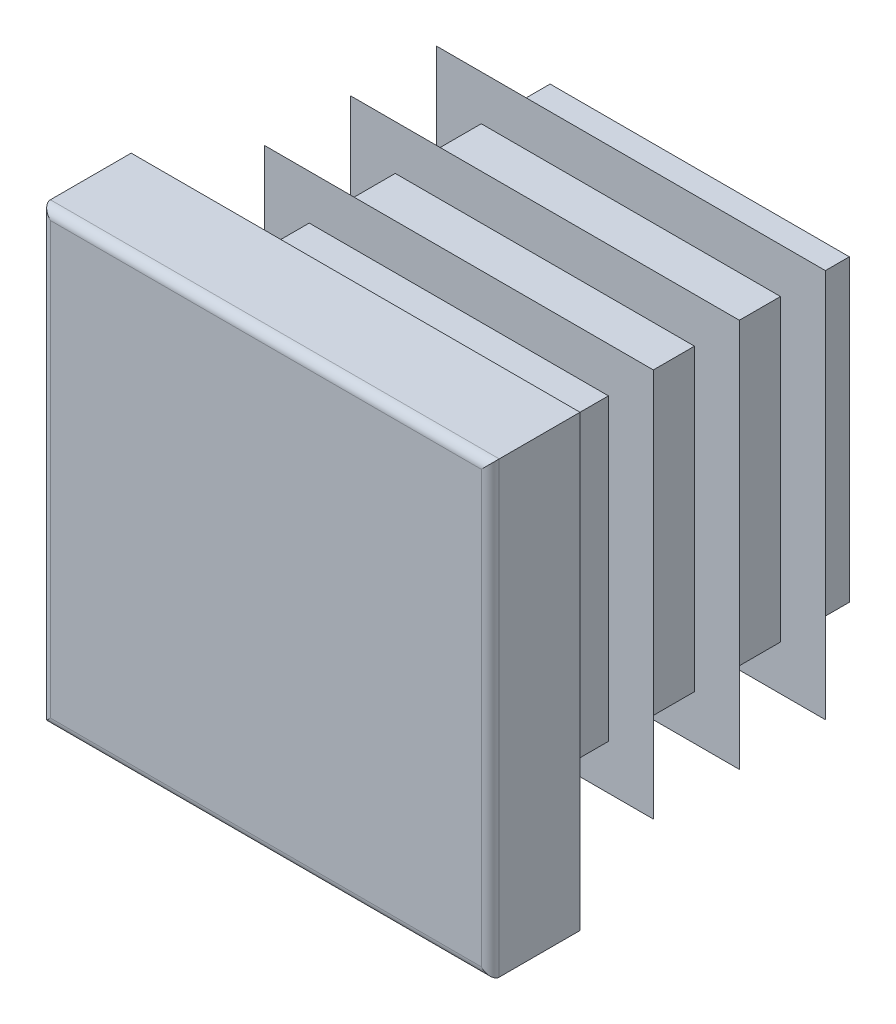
ISO-10303-21;
HEADER;
FILE_DESCRIPTION(('STEP AP214'),'2;1');
FILE_NAME('part.step','',(''),(''),'','','');
FILE_SCHEMA(('AUTOMOTIVE_DESIGN { 1 0 10303 214 1 1 1 1 }'));
ENDSEC;
DATA;
#1=APPLICATION_CONTEXT('core data for automotive mechanical design processes');
#2=APPLICATION_PROTOCOL_DEFINITION('international standard','automotive_design',2000,#1);
#3=PRODUCT_CONTEXT('',#1,'mechanical');
#4=PRODUCT('Part','Part','',(#3));
#5=PRODUCT_RELATED_PRODUCT_CATEGORY('part','',(#4));
#6=PRODUCT_DEFINITION_FORMATION('','',#4);
#7=PRODUCT_DEFINITION_CONTEXT('part definition',#1,'design');
#8=PRODUCT_DEFINITION('design','',#6,#7);
#9=PRODUCT_DEFINITION_SHAPE('','',#8);
#10=(LENGTH_UNIT() NAMED_UNIT(*) SI_UNIT(.MILLI.,.METRE.));
#11=(NAMED_UNIT(*) PLANE_ANGLE_UNIT() SI_UNIT($,.RADIAN.));
#12=(NAMED_UNIT(*) SI_UNIT($,.STERADIAN.) SOLID_ANGLE_UNIT());
#13=UNCERTAINTY_MEASURE_WITH_UNIT(LENGTH_MEASURE(1.E-05),#10,'distance_accuracy_value','');
#14=(GEOMETRIC_REPRESENTATION_CONTEXT(3) GLOBAL_UNCERTAINTY_ASSIGNED_CONTEXT((#13)) GLOBAL_UNIT_ASSIGNED_CONTEXT((#10,
#11,#12)) REPRESENTATION_CONTEXT('',''));
#15=CARTESIAN_POINT('',(0.,0.,0.));
#16=DIRECTION('',(0.,0.,1.));
#17=DIRECTION('',(1.,0.,0.));
#18=AXIS2_PLACEMENT_3D('',#15,#16,#17);
#19=CARTESIAN_POINT('',(7.2,-7.5,3.));
#20=DIRECTION('',(0.,0.,-1.));
#21=DIRECTION('',(0.,1.,0.));
#22=AXIS2_PLACEMENT_3D('',#19,#20,#21);
#23=PLANE('',#22);
#24=DIRECTION('',(0.,1.,0.));
#25=VECTOR('',#24,1.);
#26=CARTESIAN_POINT('',(-7.2,-7.5,3.));
#27=LINE('',#26,#25);
#28=CARTESIAN_POINT('',(-7.2,-7.2,3.));
#29=VERTEX_POINT('',#28);
#30=CARTESIAN_POINT('',(-7.2,7.2,3.));
#31=VERTEX_POINT('',#30);
#32=EDGE_CURVE('E262',#29,#31,#27,.T.);
#33=ORIENTED_EDGE('',*,*,#32,.F.);
#34=DIRECTION('',(-1.,0.,0.));
#35=VECTOR('',#34,1.);
#36=CARTESIAN_POINT('',(7.5,-7.2,3.));
#37=LINE('',#36,#35);
#38=CARTESIAN_POINT('',(7.2,-7.2,3.));
#39=VERTEX_POINT('',#38);
#40=EDGE_CURVE('E432',#39,#29,#37,.T.);
#41=ORIENTED_EDGE('',*,*,#40,.F.);
#42=DIRECTION('',(0.,1.,0.));
#43=VECTOR('',#42,1.);
#44=CARTESIAN_POINT('',(7.2,-7.5,3.));
#45=LINE('',#44,#43);
#46=CARTESIAN_POINT('',(7.2,7.2,3.));
#47=VERTEX_POINT('',#46);
#48=EDGE_CURVE('E257',#39,#47,#45,.T.);
#49=ORIENTED_EDGE('',*,*,#48,.T.);
#50=DIRECTION('',(-1.,0.,0.));
#51=VECTOR('',#50,1.);
#52=CARTESIAN_POINT('',(7.5,7.2,3.));
#53=LINE('',#52,#51);
#54=EDGE_CURVE('E534',#47,#31,#53,.T.);
#55=ORIENTED_EDGE('',*,*,#54,.T.);
#56=EDGE_LOOP('',(#33,#41,#49,#55));
#57=FACE_BOUND('',#56,.T.);
#58=ADVANCED_FACE('F14',(#57),#23,.F.);
#59=CARTESIAN_POINT('',(-7.2,-7.5,2.7));
#60=DIRECTION('',(0.,1.,0.));
#61=DIRECTION('',(-1.,0.,0.));
#62=AXIS2_PLACEMENT_3D('',#59,#60,#61);
#63=CYLINDRICAL_SURFACE('',#62,0.3);
#64=DIRECTION('',(0.,1.,0.));
#65=VECTOR('',#64,1.);
#66=CARTESIAN_POINT('',(-7.5,-7.5,2.7));
#67=LINE('',#66,#65);
#68=CARTESIAN_POINT('',(-7.5,-7.5,2.7));
#69=VERTEX_POINT('',#68);
#70=CARTESIAN_POINT('',(-7.5,7.5,2.7));
#71=VERTEX_POINT('',#70);
#72=EDGE_CURVE('E354',#69,#71,#67,.T.);
#73=ORIENTED_EDGE('',*,*,#72,.F.);
#74=CARTESIAN_POINT('',(-7.2,-7.2,2.7));
#75=DIRECTION('',(-0.707106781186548,0.707106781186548,0.));
#76=DIRECTION('',(0.707106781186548,0.707106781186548,0.));
#77=AXIS2_PLACEMENT_3D('',#74,#75,#76);
#78=ELLIPSE('',#77,0.424264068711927,0.3);
#79=EDGE_CURVE('E59',#69,#29,#78,.T.);
#80=ORIENTED_EDGE('',*,*,#79,.T.);
#81=ORIENTED_EDGE('',*,*,#32,.T.);
#82=CARTESIAN_POINT('',(-7.2,7.2,2.7));
#83=DIRECTION('',(0.707106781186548,0.707106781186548,0.));
#84=DIRECTION('',(-0.707106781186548,0.707106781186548,0.));
#85=AXIS2_PLACEMENT_3D('',#82,#83,#84);
#86=ELLIPSE('',#85,0.424264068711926,0.3);
#87=EDGE_CURVE('E258',#31,#71,#86,.F.);
#88=ORIENTED_EDGE('',*,*,#87,.T.);
#89=EDGE_LOOP('',(#73,#80,#81,#88));
#90=FACE_BOUND('',#89,.T.);
#91=ADVANCED_FACE('F16',(#90),#63,.T.);
#92=CARTESIAN_POINT('',(-7.5,-7.5,2.7));
#93=DIRECTION('',(1.,0.,0.));
#94=DIRECTION('',(0.,1.,0.));
#95=AXIS2_PLACEMENT_3D('',#92,#93,#94);
#96=PLANE('',#95);
#97=DIRECTION('',(0.,0.,-1.));
#98=VECTOR('',#97,1.);
#99=CARTESIAN_POINT('',(-7.5,7.5,2.7));
#100=LINE('',#99,#98);
#101=CARTESIAN_POINT('',(-7.5,7.5,0.));
#102=VERTEX_POINT('',#101);
#103=EDGE_CURVE('E519',#71,#102,#100,.T.);
#104=ORIENTED_EDGE('',*,*,#103,.T.);
#105=DIRECTION('',(0.,1.,0.));
#106=VECTOR('',#105,1.);
#107=CARTESIAN_POINT('',(-7.5,-7.5,0.));
#108=LINE('',#107,#106);
#109=CARTESIAN_POINT('',(-7.5,-7.5,0.));
#110=VERTEX_POINT('',#109);
#111=EDGE_CURVE('E352',#110,#102,#108,.T.);
#112=ORIENTED_EDGE('',*,*,#111,.F.);
#113=DIRECTION('',(0.,0.,-1.));
#114=VECTOR('',#113,1.);
#115=CARTESIAN_POINT('',(-7.5,-7.5,2.7));
#116=LINE('',#115,#114);
#117=EDGE_CURVE('E520',#69,#110,#116,.T.);
#118=ORIENTED_EDGE('',*,*,#117,.F.);
#119=ORIENTED_EDGE('',*,*,#72,.T.);
#120=EDGE_LOOP('',(#104,#112,#118,#119));
#121=FACE_BOUND('',#120,.T.);
#122=ADVANCED_FACE('F604',(#121),#96,.F.);
#123=CARTESIAN_POINT('',(-5.,-7.5,0.));
#124=DIRECTION('',(1.,0.,0.));
#125=DIRECTION('',(0.,1.,0.));
#126=AXIS2_PLACEMENT_3D('',#123,#124,#125);
#127=PLANE('',#126);
#128=DIRECTION('',(0.,1.,0.));
#129=VECTOR('',#128,1.);
#130=CARTESIAN_POINT('',(-5.,-7.5,0.));
#131=LINE('',#130,#129);
#132=CARTESIAN_POINT('',(-5.,-5.,0.));
#133=VERTEX_POINT('',#132);
#134=CARTESIAN_POINT('',(-5.,5.,0.));
#135=VERTEX_POINT('',#134);
#136=EDGE_CURVE('E349',#133,#135,#131,.T.);
#137=ORIENTED_EDGE('',*,*,#136,.T.);
#138=DIRECTION('',(0.,0.,-1.));
#139=VECTOR('',#138,1.);
#140=CARTESIAN_POINT('',(-5.,5.,0.));
#141=LINE('',#140,#139);
#142=CARTESIAN_POINT('',(-5.,5.,-0.575));
#143=VERTEX_POINT('',#142);
#144=EDGE_CURVE('E445',#135,#143,#141,.T.);
#145=ORIENTED_EDGE('',*,*,#144,.T.);
#146=DIRECTION('',(0.,1.,0.));
#147=VECTOR('',#146,1.);
#148=CARTESIAN_POINT('',(-5.,-7.5,-0.575));
#149=LINE('',#148,#147);
#150=CARTESIAN_POINT('',(-5.,-5.,-0.575));
#151=VERTEX_POINT('',#150);
#152=EDGE_CURVE('E346',#151,#143,#149,.T.);
#153=ORIENTED_EDGE('',*,*,#152,.F.);
#154=DIRECTION('',(0.,0.,1.));
#155=VECTOR('',#154,1.);
#156=CARTESIAN_POINT('',(-5.,-5.,0.));
#157=LINE('',#156,#155);
#158=EDGE_CURVE('E439',#151,#133,#157,.T.);
#159=ORIENTED_EDGE('',*,*,#158,.T.);
#160=EDGE_LOOP('',(#137,#145,#153,#159));
#161=FACE_BOUND('',#160,.T.);
#162=ADVANCED_FACE('F728',(#161),#127,.F.);
#163=CARTESIAN_POINT('',(-6.5,-7.5,-0.575));
#164=DIRECTION('',(0.573576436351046,0.,0.819152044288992));
#165=DIRECTION('',(-0.819152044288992,0.,0.573576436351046));
#166=AXIS2_PLACEMENT_3D('',#163,#164,#165);
#167=PLANE('',#166);
#168=DIRECTION('',(0.,1.,0.));
#169=VECTOR('',#168,1.);
#170=CARTESIAN_POINT('',(-6.5,-7.5,-0.575));
#171=LINE('',#170,#169);
#172=CARTESIAN_POINT('',(-6.5,-6.5,-0.575));
#173=VERTEX_POINT('',#172);
#174=CARTESIAN_POINT('',(-6.5,6.5,-0.575));
#175=VERTEX_POINT('',#174);
#176=EDGE_CURVE('E344',#173,#175,#171,.T.);
#177=ORIENTED_EDGE('',*,*,#176,.T.);
#178=DIRECTION('',(0.633687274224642,-0.633687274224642,-0.443712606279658));
#179=VECTOR('',#178,1.);
#180=CARTESIAN_POINT('',(-0.878166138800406,0.878166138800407,-4.51145044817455));
#181=LINE('',#180,#179);
#182=CARTESIAN_POINT('',(-5.,5.,-1.62531130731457));
#183=VERTEX_POINT('',#182);
#184=EDGE_CURVE('E457',#175,#183,#181,.T.);
#185=ORIENTED_EDGE('',*,*,#184,.T.);
#186=DIRECTION('',(0.,1.,0.));
#187=VECTOR('',#186,1.);
#188=CARTESIAN_POINT('',(-5.,-7.5,-1.62531130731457));
#189=LINE('',#188,#187);
#190=CARTESIAN_POINT('',(-5.,-5.,-1.62531130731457));
#191=VERTEX_POINT('',#190);
#192=EDGE_CURVE('E341',#191,#183,#189,.T.);
#193=ORIENTED_EDGE('',*,*,#192,.F.);
#194=DIRECTION('',(-0.633687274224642,-0.633687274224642,0.443712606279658));
#195=VECTOR('',#194,1.);
#196=CARTESIAN_POINT('',(-6.90155956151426,-6.90155956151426,-0.293824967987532));
#197=LINE('',#196,#195);
#198=EDGE_CURVE('E451',#191,#173,#197,.T.);
#199=ORIENTED_EDGE('',*,*,#198,.T.);
#200=EDGE_LOOP('',(#177,#185,#193,#199));
#201=FACE_BOUND('',#200,.T.);
#202=ADVANCED_FACE('F732',(#201),#167,.F.);
#203=CARTESIAN_POINT('',(-5.,-7.5,-1.62531130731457));
#204=DIRECTION('',(1.,0.,0.));
#205=DIRECTION('',(0.,1.,0.));
#206=AXIS2_PLACEMENT_3D('',#203,#204,#205);
#207=PLANE('',#206);
#208=ORIENTED_EDGE('',*,*,#192,.T.);
#209=DIRECTION('',(0.,0.,-1.));
#210=VECTOR('',#209,1.);
#211=CARTESIAN_POINT('',(-5.,5.,-1.62531130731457));
#212=LINE('',#211,#210);
#213=CARTESIAN_POINT('',(-5.,5.,-3.45));
#214=VERTEX_POINT('',#213);
#215=EDGE_CURVE('E463',#183,#214,#212,.T.);
#216=ORIENTED_EDGE('',*,*,#215,.T.);
#217=DIRECTION('',(0.,1.,0.));
#218=VECTOR('',#217,1.);
#219=CARTESIAN_POINT('',(-5.,-7.5,-3.45));
#220=LINE('',#219,#218);
#221=CARTESIAN_POINT('',(-5.,-5.,-3.45));
#222=VERTEX_POINT('',#221);
#223=EDGE_CURVE('E338',#222,#214,#220,.T.);
#224=ORIENTED_EDGE('',*,*,#223,.F.);
#225=DIRECTION('',(0.,0.,1.));
#226=VECTOR('',#225,1.);
#227=CARTESIAN_POINT('',(-5.,-5.,-1.62531130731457));
#228=LINE('',#227,#226);
#229=EDGE_CURVE('E460',#222,#191,#228,.T.);
#230=ORIENTED_EDGE('',*,*,#229,.T.);
#231=EDGE_LOOP('',(#208,#216,#224,#230));
#232=FACE_BOUND('',#231,.T.);
#233=ADVANCED_FACE('F738',(#232),#207,.F.);
#234=CARTESIAN_POINT('',(-6.5,-7.5,-3.45));
#235=DIRECTION('',(0.573576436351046,0.,0.819152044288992));
#236=DIRECTION('',(-0.819152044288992,0.,0.573576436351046));
#237=AXIS2_PLACEMENT_3D('',#234,#235,#236);
#238=PLANE('',#237);
#239=DIRECTION('',(0.,1.,0.));
#240=VECTOR('',#239,1.);
#241=CARTESIAN_POINT('',(-6.5,-7.5,-3.45));
#242=LINE('',#241,#240);
#243=CARTESIAN_POINT('',(-6.5,-6.5,-3.45));
#244=VERTEX_POINT('',#243);
#245=CARTESIAN_POINT('',(-6.5,6.5,-3.45));
#246=VERTEX_POINT('',#245);
#247=EDGE_CURVE('E336',#244,#246,#242,.T.);
#248=ORIENTED_EDGE('',*,*,#247,.T.);
#249=DIRECTION('',(0.633687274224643,-0.633687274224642,-0.443712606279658));
#250=VECTOR('',#249,1.);
#251=CARTESIAN_POINT('',(-0.878166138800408,0.878166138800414,-7.38645044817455));
#252=LINE('',#251,#250);
#253=CARTESIAN_POINT('',(-5.,5.,-4.50031130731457));
#254=VERTEX_POINT('',#253);
#255=EDGE_CURVE('E475',#246,#254,#252,.T.);
#256=ORIENTED_EDGE('',*,*,#255,.T.);
#257=DIRECTION('',(0.,1.,0.));
#258=VECTOR('',#257,1.);
#259=CARTESIAN_POINT('',(-5.,-7.5,-4.50031130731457));
#260=LINE('',#259,#258);
#261=CARTESIAN_POINT('',(-5.,-5.,-4.50031130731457));
#262=VERTEX_POINT('',#261);
#263=EDGE_CURVE('E333',#262,#254,#260,.T.);
#264=ORIENTED_EDGE('',*,*,#263,.F.);
#265=DIRECTION('',(-0.633687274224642,-0.633687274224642,0.443712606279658));
#266=VECTOR('',#265,1.);
#267=CARTESIAN_POINT('',(-6.90155956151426,-6.90155956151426,-3.16882496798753));
#268=LINE('',#267,#266);
#269=EDGE_CURVE('E469',#262,#244,#268,.T.);
#270=ORIENTED_EDGE('',*,*,#269,.T.);
#271=EDGE_LOOP('',(#248,#256,#264,#270));
#272=FACE_BOUND('',#271,.T.);
#273=ADVANCED_FACE('F742',(#272),#238,.F.);
#274=CARTESIAN_POINT('',(-5.,-7.5,-4.50031130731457));
#275=DIRECTION('',(1.,0.,0.));
#276=DIRECTION('',(0.,1.,0.));
#277=AXIS2_PLACEMENT_3D('',#274,#275,#276);
#278=PLANE('',#277);
#279=ORIENTED_EDGE('',*,*,#263,.T.);
#280=DIRECTION('',(0.,0.,-1.));
#281=VECTOR('',#280,1.);
#282=CARTESIAN_POINT('',(-5.,5.,-4.50031130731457));
#283=LINE('',#282,#281);
#284=CARTESIAN_POINT('',(-5.,5.,-6.325));
#285=VERTEX_POINT('',#284);
#286=EDGE_CURVE('E481',#254,#285,#283,.T.);
#287=ORIENTED_EDGE('',*,*,#286,.T.);
#288=DIRECTION('',(0.,1.,0.));
#289=VECTOR('',#288,1.);
#290=CARTESIAN_POINT('',(-5.,-7.5,-6.325));
#291=LINE('',#290,#289);
#292=CARTESIAN_POINT('',(-5.,-5.,-6.325));
#293=VERTEX_POINT('',#292);
#294=EDGE_CURVE('E330',#293,#285,#291,.T.);
#295=ORIENTED_EDGE('',*,*,#294,.F.);
#296=DIRECTION('',(0.,0.,1.));
#297=VECTOR('',#296,1.);
#298=CARTESIAN_POINT('',(-5.,-5.,-4.50031130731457));
#299=LINE('',#298,#297);
#300=EDGE_CURVE('E478',#293,#262,#299,.T.);
#301=ORIENTED_EDGE('',*,*,#300,.T.);
#302=EDGE_LOOP('',(#279,#287,#295,#301));
#303=FACE_BOUND('',#302,.T.);
#304=ADVANCED_FACE('F746',(#303),#278,.F.);
#305=CARTESIAN_POINT('',(-6.5,-7.5,-6.325));
#306=DIRECTION('',(0.573576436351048,0.,0.819152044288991));
#307=DIRECTION('',(-0.819152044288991,0.,0.573576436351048));
#308=AXIS2_PLACEMENT_3D('',#305,#306,#307);
#309=PLANE('',#308);
#310=DIRECTION('',(0.,1.,0.));
#311=VECTOR('',#310,1.);
#312=CARTESIAN_POINT('',(-6.5,-7.5,-6.325));
#313=LINE('',#312,#311);
#314=CARTESIAN_POINT('',(-6.5,-6.5,-6.325));
#315=VERTEX_POINT('',#314);
#316=CARTESIAN_POINT('',(-6.5,6.5,-6.325));
#317=VERTEX_POINT('',#316);
#318=EDGE_CURVE('E328',#315,#317,#313,.T.);
#319=ORIENTED_EDGE('',*,*,#318,.T.);
#320=DIRECTION('',(0.633687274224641,-0.633687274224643,-0.443712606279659));
#321=VECTOR('',#320,1.);
#322=CARTESIAN_POINT('',(-0.878166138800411,0.878166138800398,-10.2614504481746));
#323=LINE('',#322,#321);
#324=CARTESIAN_POINT('',(-5.,5.,-7.37531130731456));
#325=VERTEX_POINT('',#324);
#326=EDGE_CURVE('E493',#317,#325,#323,.T.);
#327=ORIENTED_EDGE('',*,*,#326,.T.);
#328=DIRECTION('',(0.,1.,0.));
#329=VECTOR('',#328,1.);
#330=CARTESIAN_POINT('',(-5.,-7.5,-7.37531130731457));
#331=LINE('',#330,#329);
#332=CARTESIAN_POINT('',(-5.,-5.,-7.37531130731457));
#333=VERTEX_POINT('',#332);
#334=EDGE_CURVE('E325',#333,#325,#331,.T.);
#335=ORIENTED_EDGE('',*,*,#334,.F.);
#336=DIRECTION('',(-0.633687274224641,-0.633687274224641,0.44371260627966));
#337=VECTOR('',#336,1.);
#338=CARTESIAN_POINT('',(-6.90155956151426,-6.90155956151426,-6.04382496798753));
#339=LINE('',#338,#337);
#340=EDGE_CURVE('E487',#333,#315,#339,.T.);
#341=ORIENTED_EDGE('',*,*,#340,.T.);
#342=EDGE_LOOP('',(#319,#327,#335,#341));
#343=FACE_BOUND('',#342,.T.);
#344=ADVANCED_FACE('F668',(#343),#309,.F.);
#345=CARTESIAN_POINT('',(-5.,-7.5,-7.37531130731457));
#346=DIRECTION('',(1.,0.,0.));
#347=DIRECTION('',(0.,1.,0.));
#348=AXIS2_PLACEMENT_3D('',#345,#346,#347);
#349=PLANE('',#348);
#350=ORIENTED_EDGE('',*,*,#334,.T.);
#351=DIRECTION('',(0.,0.,-1.));
#352=VECTOR('',#351,1.);
#353=CARTESIAN_POINT('',(-5.,5.,-7.37531130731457));
#354=LINE('',#353,#352);
#355=CARTESIAN_POINT('',(-5.,5.,-9.2));
#356=VERTEX_POINT('',#355);
#357=EDGE_CURVE('E499',#325,#356,#354,.T.);
#358=ORIENTED_EDGE('',*,*,#357,.T.);
#359=DIRECTION('',(0.,1.,0.));
#360=VECTOR('',#359,1.);
#361=CARTESIAN_POINT('',(-5.,-7.5,-9.2));
#362=LINE('',#361,#360);
#363=CARTESIAN_POINT('',(-5.,-5.,-9.2));
#364=VERTEX_POINT('',#363);
#365=EDGE_CURVE('E322',#364,#356,#362,.T.);
#366=ORIENTED_EDGE('',*,*,#365,.F.);
#367=DIRECTION('',(0.,0.,1.));
#368=VECTOR('',#367,1.);
#369=CARTESIAN_POINT('',(-5.,-5.,-7.37531130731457));
#370=LINE('',#369,#368);
#371=EDGE_CURVE('E496',#364,#333,#370,.T.);
#372=ORIENTED_EDGE('',*,*,#371,.T.);
#373=EDGE_LOOP('',(#350,#358,#366,#372));
#374=FACE_BOUND('',#373,.T.);
#375=ADVANCED_FACE('F665',(#374),#349,.F.);
#376=CARTESIAN_POINT('',(-6.5,-7.5,-9.2));
#377=DIRECTION('',(0.573576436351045,0.,0.819152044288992));
#378=DIRECTION('',(-0.819152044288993,0.,0.573576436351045));
#379=AXIS2_PLACEMENT_3D('',#376,#377,#378);
#380=PLANE('',#379);
#381=DIRECTION('',(0.,1.,0.));
#382=VECTOR('',#381,1.);
#383=CARTESIAN_POINT('',(-6.5,-7.5,-9.2));
#384=LINE('',#383,#382);
#385=CARTESIAN_POINT('',(-6.5,-6.5,-9.2));
#386=VERTEX_POINT('',#385);
#387=CARTESIAN_POINT('',(-6.5,6.5,-9.2));
#388=VERTEX_POINT('',#387);
#389=EDGE_CURVE('E320',#386,#388,#384,.T.);
#390=ORIENTED_EDGE('',*,*,#389,.T.);
#391=DIRECTION('',(0.633687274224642,-0.633687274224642,-0.443712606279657));
#392=VECTOR('',#391,1.);
#393=CARTESIAN_POINT('',(-0.878166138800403,0.878166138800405,-13.1364504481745));
#394=LINE('',#393,#392);
#395=CARTESIAN_POINT('',(-5.,5.,-10.2503113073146));
#396=VERTEX_POINT('',#395);
#397=EDGE_CURVE('E511',#388,#396,#394,.T.);
#398=ORIENTED_EDGE('',*,*,#397,.T.);
#399=DIRECTION('',(0.,1.,0.));
#400=VECTOR('',#399,1.);
#401=CARTESIAN_POINT('',(-5.,-7.5,-10.2503113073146));
#402=LINE('',#401,#400);
#403=CARTESIAN_POINT('',(-5.,-5.,-10.2503113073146));
#404=VERTEX_POINT('',#403);
#405=EDGE_CURVE('E317',#404,#396,#402,.T.);
#406=ORIENTED_EDGE('',*,*,#405,.F.);
#407=DIRECTION('',(-0.633687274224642,-0.633687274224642,0.443712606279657));
#408=VECTOR('',#407,1.);
#409=CARTESIAN_POINT('',(-6.90155956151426,-6.90155956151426,-8.91882496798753));
#410=LINE('',#409,#408);
#411=EDGE_CURVE('E505',#404,#386,#410,.T.);
#412=ORIENTED_EDGE('',*,*,#411,.T.);
#413=EDGE_LOOP('',(#390,#398,#406,#412));
#414=FACE_BOUND('',#413,.T.);
#415=ADVANCED_FACE('F580',(#414),#380,.F.);
#416=CARTESIAN_POINT('',(-5.,-7.5,-10.2503113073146));
#417=DIRECTION('',(1.,0.,0.));
#418=DIRECTION('',(0.,1.,0.));
#419=AXIS2_PLACEMENT_3D('',#416,#417,#418);
#420=PLANE('',#419);
#421=ORIENTED_EDGE('',*,*,#405,.T.);
#422=DIRECTION('',(0.,0.,-1.));
#423=VECTOR('',#422,1.);
#424=CARTESIAN_POINT('',(-5.,5.,-10.2503113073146));
#425=LINE('',#424,#423);
#426=CARTESIAN_POINT('',(-5.,5.,-11.5));
#427=VERTEX_POINT('',#426);
#428=EDGE_CURVE('E517',#396,#427,#425,.T.);
#429=ORIENTED_EDGE('',*,*,#428,.T.);
#430=DIRECTION('',(0.,1.,0.));
#431=VECTOR('',#430,1.);
#432=CARTESIAN_POINT('',(-5.,-7.5,-11.5));
#433=LINE('',#432,#431);
#434=CARTESIAN_POINT('',(-5.,-5.,-11.5));
#435=VERTEX_POINT('',#434);
#436=EDGE_CURVE('E314',#435,#427,#433,.T.);
#437=ORIENTED_EDGE('',*,*,#436,.F.);
#438=DIRECTION('',(0.,0.,1.));
#439=VECTOR('',#438,1.);
#440=CARTESIAN_POINT('',(-5.,-5.,-10.2503113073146));
#441=LINE('',#440,#439);
#442=EDGE_CURVE('E514',#435,#404,#441,.T.);
#443=ORIENTED_EDGE('',*,*,#442,.T.);
#444=EDGE_LOOP('',(#421,#429,#437,#443));
#445=FACE_BOUND('',#444,.T.);
#446=ADVANCED_FACE('F582',(#445),#420,.F.);
#447=CARTESIAN_POINT('',(-5.,-7.5,-11.5));
#448=DIRECTION('',(0.,0.,1.));
#449=DIRECTION('',(0.,-1.,0.));
#450=AXIS2_PLACEMENT_3D('',#447,#448,#449);
#451=PLANE('',#450);
#452=ORIENTED_EDGE('',*,*,#436,.T.);
#453=DIRECTION('',(-1.,0.,0.));
#454=VECTOR('',#453,1.);
#455=CARTESIAN_POINT('',(7.5,5.,-11.5));
#456=LINE('',#455,#454);
#457=CARTESIAN_POINT('',(5.,5.,-11.5));
#458=VERTEX_POINT('',#457);
#459=EDGE_CURVE('E388',#458,#427,#456,.T.);
#460=ORIENTED_EDGE('',*,*,#459,.F.);
#461=DIRECTION('',(0.,1.,0.));
#462=VECTOR('',#461,1.);
#463=CARTESIAN_POINT('',(5.,-7.5,-11.5));
#464=LINE('',#463,#462);
#465=CARTESIAN_POINT('',(5.,-5.,-11.5));
#466=VERTEX_POINT('',#465);
#467=EDGE_CURVE('E311',#466,#458,#464,.T.);
#468=ORIENTED_EDGE('',*,*,#467,.F.);
#469=DIRECTION('',(-1.,0.,0.));
#470=VECTOR('',#469,1.);
#471=CARTESIAN_POINT('',(7.5,-5.,-11.5));
#472=LINE('',#471,#470);
#473=EDGE_CURVE('E386',#466,#435,#472,.T.);
#474=ORIENTED_EDGE('',*,*,#473,.T.);
#475=EDGE_LOOP('',(#452,#460,#468,#474));
#476=FACE_BOUND('',#475,.T.);
#477=ADVANCED_FACE('F385',(#476),#451,.F.);
#478=CARTESIAN_POINT('',(5.,-7.5,-11.5));
#479=DIRECTION('',(-1.,0.,0.));
#480=DIRECTION('',(0.,-1.,0.));
#481=AXIS2_PLACEMENT_3D('',#478,#479,#480);
#482=PLANE('',#481);
#483=ORIENTED_EDGE('',*,*,#467,.T.);
#484=DIRECTION('',(0.,0.,1.));
#485=VECTOR('',#484,1.);
#486=CARTESIAN_POINT('',(5.,5.,-11.5));
#487=LINE('',#486,#485);
#488=CARTESIAN_POINT('',(5.,5.,-10.2503113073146));
#489=VERTEX_POINT('',#488);
#490=EDGE_CURVE('E9',#458,#489,#487,.T.);
#491=ORIENTED_EDGE('',*,*,#490,.T.);
#492=DIRECTION('',(0.,1.,0.));
#493=VECTOR('',#492,1.);
#494=CARTESIAN_POINT('',(5.,-7.5,-10.2503113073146));
#495=LINE('',#494,#493);
#496=CARTESIAN_POINT('',(5.,-5.,-10.2503113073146));
#497=VERTEX_POINT('',#496);
#498=EDGE_CURVE('E308',#497,#489,#495,.T.);
#499=ORIENTED_EDGE('',*,*,#498,.F.);
#500=DIRECTION('',(0.,0.,-1.));
#501=VECTOR('',#500,1.);
#502=CARTESIAN_POINT('',(5.,-5.,-11.5));
#503=LINE('',#502,#501);
#504=EDGE_CURVE('E23',#497,#466,#503,.T.);
#505=ORIENTED_EDGE('',*,*,#504,.T.);
#506=EDGE_LOOP('',(#483,#491,#499,#505));
#507=FACE_BOUND('',#506,.T.);
#508=ADVANCED_FACE('F378',(#507),#482,.F.);
#509=CARTESIAN_POINT('',(5.,-7.5,-10.2503113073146));
#510=DIRECTION('',(-0.573576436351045,0.,0.819152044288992));
#511=DIRECTION('',(-0.819152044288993,0.,-0.573576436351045));
#512=AXIS2_PLACEMENT_3D('',#509,#510,#511);
#513=PLANE('',#512);
#514=ORIENTED_EDGE('',*,*,#498,.T.);
#515=DIRECTION('',(0.633687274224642,0.633687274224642,0.443712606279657));
#516=VECTOR('',#515,1.);
#517=CARTESIAN_POINT('',(-0.019494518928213,-0.0194945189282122,-13.7649992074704));
#518=LINE('',#517,#516);
#519=CARTESIAN_POINT('',(6.5,6.5,-9.2));
#520=VERTEX_POINT('',#519);
#521=EDGE_CURVE('E508',#489,#520,#518,.T.);
#522=ORIENTED_EDGE('',*,*,#521,.T.);
#523=DIRECTION('',(0.,1.,0.));
#524=VECTOR('',#523,1.);
#525=CARTESIAN_POINT('',(6.5,-7.5,-9.2));
#526=LINE('',#525,#524);
#527=CARTESIAN_POINT('',(6.5,-6.5,-9.2));
#528=VERTEX_POINT('',#527);
#529=EDGE_CURVE('E305',#528,#520,#526,.T.);
#530=ORIENTED_EDGE('',*,*,#529,.F.);
#531=DIRECTION('',(-0.633687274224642,0.633687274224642,-0.443712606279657));
#532=VECTOR('',#531,1.);
#533=CARTESIAN_POINT('',(6.00389890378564,-6.00389890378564,-9.54737372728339));
#534=LINE('',#533,#532);
#535=EDGE_CURVE('E502',#528,#497,#534,.T.);
#536=ORIENTED_EDGE('',*,*,#535,.T.);
#537=EDGE_LOOP('',(#514,#522,#530,#536));
#538=FACE_BOUND('',#537,.T.);
#539=ADVANCED_FACE('F588',(#538),#513,.F.);
#540=CARTESIAN_POINT('',(6.5,-7.5,-9.2));
#541=DIRECTION('',(0.,0.,-1.));
#542=DIRECTION('',(0.,1.,0.));
#543=AXIS2_PLACEMENT_3D('',#540,#541,#542);
#544=PLANE('',#543);
#545=ORIENTED_EDGE('',*,*,#529,.T.);
#546=DIRECTION('',(-1.,0.,0.));
#547=VECTOR('',#546,1.);
#548=CARTESIAN_POINT('',(7.5,6.5,-9.2));
#549=LINE('',#548,#547);
#550=EDGE_CURVE('E394',#520,#388,#549,.T.);
#551=ORIENTED_EDGE('',*,*,#550,.T.);
#552=ORIENTED_EDGE('',*,*,#389,.F.);
#553=DIRECTION('',(-1.,0.,0.));
#554=VECTOR('',#553,1.);
#555=CARTESIAN_POINT('',(7.5,-6.5,-9.2));
#556=LINE('',#555,#554);
#557=EDGE_CURVE('E401',#528,#386,#556,.T.);
#558=ORIENTED_EDGE('',*,*,#557,.F.);
#559=EDGE_LOOP('',(#545,#551,#552,#558));
#560=FACE_BOUND('',#559,.T.);
#561=ORIENTED_EDGE('',*,*,#365,.T.);
#562=DIRECTION('',(-1.,0.,0.));
#563=VECTOR('',#562,1.);
#564=CARTESIAN_POINT('',(7.5,5.,-9.2));
#565=LINE('',#564,#563);
#566=CARTESIAN_POINT('',(5.,5.,-9.2));
#567=VERTEX_POINT('',#566);
#568=EDGE_CURVE('E567',#567,#356,#565,.T.);
#569=ORIENTED_EDGE('',*,*,#568,.F.);
#570=DIRECTION('',(0.,1.,0.));
#571=VECTOR('',#570,1.);
#572=CARTESIAN_POINT('',(5.,-7.5,-9.2));
#573=LINE('',#572,#571);
#574=CARTESIAN_POINT('',(5.,-5.,-9.2));
#575=VERTEX_POINT('',#574);
#576=EDGE_CURVE('E302',#575,#567,#573,.T.);
#577=ORIENTED_EDGE('',*,*,#576,.F.);
#578=DIRECTION('',(-1.,0.,0.));
#579=VECTOR('',#578,1.);
#580=CARTESIAN_POINT('',(7.5,-5.,-9.2));
#581=LINE('',#580,#579);
#582=EDGE_CURVE('E403',#575,#364,#581,.T.);
#583=ORIENTED_EDGE('',*,*,#582,.T.);
#584=EDGE_LOOP('',(#561,#569,#577,#583));
#585=FACE_BOUND('',#584,.T.);
#586=ADVANCED_FACE('F571',(#560,#585),#544,.F.);
#587=CARTESIAN_POINT('',(5.,-7.5,-9.2));
#588=DIRECTION('',(-1.,0.,0.));
#589=DIRECTION('',(0.,-1.,0.));
#590=AXIS2_PLACEMENT_3D('',#587,#588,#589);
#591=PLANE('',#590);
#592=ORIENTED_EDGE('',*,*,#576,.T.);
#593=DIRECTION('',(0.,0.,1.));
#594=VECTOR('',#593,1.);
#595=CARTESIAN_POINT('',(5.,5.,-9.2));
#596=LINE('',#595,#594);
#597=CARTESIAN_POINT('',(5.,5.,-7.37531130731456));
#598=VERTEX_POINT('',#597);
#599=EDGE_CURVE('E372',#567,#598,#596,.T.);
#600=ORIENTED_EDGE('',*,*,#599,.T.);
#601=DIRECTION('',(0.,1.,0.));
#602=VECTOR('',#601,1.);
#603=CARTESIAN_POINT('',(5.,-7.5,-7.37531130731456));
#604=LINE('',#603,#602);
#605=CARTESIAN_POINT('',(5.,-5.,-7.37531130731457));
#606=VERTEX_POINT('',#605);
#607=EDGE_CURVE('E299',#606,#598,#604,.T.);
#608=ORIENTED_EDGE('',*,*,#607,.F.);
#609=DIRECTION('',(0.,0.,-1.));
#610=VECTOR('',#609,1.);
#611=CARTESIAN_POINT('',(5.,-5.,-9.2));
#612=LINE('',#611,#610);
#613=EDGE_CURVE('E369',#606,#575,#612,.T.);
#614=ORIENTED_EDGE('',*,*,#613,.T.);
#615=EDGE_LOOP('',(#592,#600,#608,#614));
#616=FACE_BOUND('',#615,.T.);
#617=ADVANCED_FACE('F596',(#616),#591,.F.);
#618=CARTESIAN_POINT('',(5.,-7.5,-7.37531130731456));
#619=DIRECTION('',(-0.573576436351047,0.,0.819152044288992));
#620=DIRECTION('',(-0.819152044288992,0.,-0.573576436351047));
#621=AXIS2_PLACEMENT_3D('',#618,#619,#620);
#622=PLANE('',#621);
#623=ORIENTED_EDGE('',*,*,#607,.T.);
#624=DIRECTION('',(0.633687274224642,0.633687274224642,0.443712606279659));
#625=VECTOR('',#624,1.);
#626=CARTESIAN_POINT('',(-0.019494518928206,-0.0194945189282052,-10.8899992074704));
#627=LINE('',#626,#625);
#628=CARTESIAN_POINT('',(6.5,6.5,-6.325));
#629=VERTEX_POINT('',#628);
#630=EDGE_CURVE('E490',#598,#629,#627,.T.);
#631=ORIENTED_EDGE('',*,*,#630,.T.);
#632=DIRECTION('',(0.,1.,0.));
#633=VECTOR('',#632,1.);
#634=CARTESIAN_POINT('',(6.5,-7.5,-6.325));
#635=LINE('',#634,#633);
#636=CARTESIAN_POINT('',(6.5,-6.5,-6.325));
#637=VERTEX_POINT('',#636);
#638=EDGE_CURVE('E296',#637,#629,#635,.T.);
#639=ORIENTED_EDGE('',*,*,#638,.F.);
#640=DIRECTION('',(-0.633687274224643,0.633687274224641,-0.443712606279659));
#641=VECTOR('',#640,1.);
#642=CARTESIAN_POINT('',(6.00389890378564,-6.00389890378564,-6.6723737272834));
#643=LINE('',#642,#641);
#644=EDGE_CURVE('E484',#637,#606,#643,.T.);
#645=ORIENTED_EDGE('',*,*,#644,.T.);
#646=EDGE_LOOP('',(#623,#631,#639,#645));
#647=FACE_BOUND('',#646,.T.);
#648=ADVANCED_FACE('F648',(#647),#622,.F.);
#649=CARTESIAN_POINT('',(6.5,-7.5,-6.325));
#650=DIRECTION('',(0.,0.,-1.));
#651=DIRECTION('',(0.,1.,0.));
#652=AXIS2_PLACEMENT_3D('',#649,#650,#651);
#653=PLANE('',#652);
#654=ORIENTED_EDGE('',*,*,#638,.T.);
#655=DIRECTION('',(-1.,0.,0.));
#656=VECTOR('',#655,1.);
#657=CARTESIAN_POINT('',(7.5,6.5,-6.325));
#658=LINE('',#657,#656);
#659=EDGE_CURVE('E561',#629,#317,#658,.T.);
#660=ORIENTED_EDGE('',*,*,#659,.T.);
#661=ORIENTED_EDGE('',*,*,#318,.F.);
#662=DIRECTION('',(-1.,0.,0.));
#663=VECTOR('',#662,1.);
#664=CARTESIAN_POINT('',(7.5,-6.5,-6.325));
#665=LINE('',#664,#663);
#666=EDGE_CURVE('E409',#637,#315,#665,.T.);
#667=ORIENTED_EDGE('',*,*,#666,.F.);
#668=EDGE_LOOP('',(#654,#660,#661,#667));
#669=FACE_BOUND('',#668,.T.);
#670=ORIENTED_EDGE('',*,*,#294,.T.);
#671=DIRECTION('',(-1.,0.,0.));
#672=VECTOR('',#671,1.);
#673=CARTESIAN_POINT('',(7.5,5.,-6.325));
#674=LINE('',#673,#672);
#675=CARTESIAN_POINT('',(5.,5.,-6.325));
#676=VERTEX_POINT('',#675);
#677=EDGE_CURVE('E559',#676,#285,#674,.T.);
#678=ORIENTED_EDGE('',*,*,#677,.F.);
#679=DIRECTION('',(0.,1.,0.));
#680=VECTOR('',#679,1.);
#681=CARTESIAN_POINT('',(5.,-7.5,-6.325));
#682=LINE('',#681,#680);
#683=CARTESIAN_POINT('',(5.,-5.,-6.325));
#684=VERTEX_POINT('',#683);
#685=EDGE_CURVE('E293',#684,#676,#682,.T.);
#686=ORIENTED_EDGE('',*,*,#685,.F.);
#687=DIRECTION('',(-1.,0.,0.));
#688=VECTOR('',#687,1.);
#689=CARTESIAN_POINT('',(7.5,-5.,-6.325));
#690=LINE('',#689,#688);
#691=EDGE_CURVE('E411',#684,#293,#690,.T.);
#692=ORIENTED_EDGE('',*,*,#691,.T.);
#693=EDGE_LOOP('',(#670,#678,#686,#692));
#694=FACE_BOUND('',#693,.T.);
#695=ADVANCED_FACE('F644',(#669,#694),#653,.F.);
#696=CARTESIAN_POINT('',(5.,-7.5,-6.325));
#697=DIRECTION('',(-1.,0.,0.));
#698=DIRECTION('',(0.,-1.,0.));
#699=AXIS2_PLACEMENT_3D('',#696,#697,#698);
#700=PLANE('',#699);
#701=ORIENTED_EDGE('',*,*,#685,.T.);
#702=DIRECTION('',(0.,0.,1.));
#703=VECTOR('',#702,1.);
#704=CARTESIAN_POINT('',(5.,5.,-6.325));
#705=LINE('',#704,#703);
#706=CARTESIAN_POINT('',(5.,5.,-4.50031130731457));
#707=VERTEX_POINT('',#706);
#708=EDGE_CURVE('E366',#676,#707,#705,.T.);
#709=ORIENTED_EDGE('',*,*,#708,.T.);
#710=DIRECTION('',(0.,1.,0.));
#711=VECTOR('',#710,1.);
#712=CARTESIAN_POINT('',(5.,-7.5,-4.50031130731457));
#713=LINE('',#712,#711);
#714=CARTESIAN_POINT('',(5.,-5.,-4.50031130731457));
#715=VERTEX_POINT('',#714);
#716=EDGE_CURVE('E290',#715,#707,#713,.T.);
#717=ORIENTED_EDGE('',*,*,#716,.F.);
#718=DIRECTION('',(0.,0.,-1.));
#719=VECTOR('',#718,1.);
#720=CARTESIAN_POINT('',(5.,-5.,-6.325));
#721=LINE('',#720,#719);
#722=EDGE_CURVE('E363',#715,#684,#721,.T.);
#723=ORIENTED_EDGE('',*,*,#722,.T.);
#724=EDGE_LOOP('',(#701,#709,#717,#723));
#725=FACE_BOUND('',#724,.T.);
#726=ADVANCED_FACE('F640',(#725),#700,.F.);
#727=CARTESIAN_POINT('',(5.,-7.5,-4.50031130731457));
#728=DIRECTION('',(-0.573576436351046,0.,0.819152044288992));
#729=DIRECTION('',(-0.819152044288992,0.,-0.573576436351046));
#730=AXIS2_PLACEMENT_3D('',#727,#728,#729);
#731=PLANE('',#730);
#732=ORIENTED_EDGE('',*,*,#716,.T.);
#733=DIRECTION('',(0.633687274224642,0.633687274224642,0.443712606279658));
#734=VECTOR('',#733,1.);
#735=CARTESIAN_POINT('',(-0.0194945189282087,-0.019494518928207,-8.01499920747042));
#736=LINE('',#735,#734);
#737=CARTESIAN_POINT('',(6.5,6.5,-3.45));
#738=VERTEX_POINT('',#737);
#739=EDGE_CURVE('E472',#707,#738,#736,.T.);
#740=ORIENTED_EDGE('',*,*,#739,.T.);
#741=DIRECTION('',(0.,1.,0.));
#742=VECTOR('',#741,1.);
#743=CARTESIAN_POINT('',(6.5,-7.5,-3.45));
#744=LINE('',#743,#742);
#745=CARTESIAN_POINT('',(6.5,-6.5,-3.45));
#746=VERTEX_POINT('',#745);
#747=EDGE_CURVE('E287',#746,#738,#744,.T.);
#748=ORIENTED_EDGE('',*,*,#747,.F.);
#749=DIRECTION('',(-0.633687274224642,0.633687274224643,-0.443712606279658));
#750=VECTOR('',#749,1.);
#751=CARTESIAN_POINT('',(6.00389890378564,-6.00389890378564,-3.79737372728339));
#752=LINE('',#751,#750);
#753=EDGE_CURVE('E466',#746,#715,#752,.T.);
#754=ORIENTED_EDGE('',*,*,#753,.T.);
#755=EDGE_LOOP('',(#732,#740,#748,#754));
#756=FACE_BOUND('',#755,.T.);
#757=ADVANCED_FACE('F636',(#756),#731,.F.);
#758=CARTESIAN_POINT('',(6.5,-7.5,-3.45));
#759=DIRECTION('',(0.,0.,-1.));
#760=DIRECTION('',(0.,1.,0.));
#761=AXIS2_PLACEMENT_3D('',#758,#759,#760);
#762=PLANE('',#761);
#763=ORIENTED_EDGE('',*,*,#747,.T.);
#764=DIRECTION('',(-1.,0.,0.));
#765=VECTOR('',#764,1.);
#766=CARTESIAN_POINT('',(7.5,6.5,-3.45));
#767=LINE('',#766,#765);
#768=EDGE_CURVE('E553',#738,#246,#767,.T.);
#769=ORIENTED_EDGE('',*,*,#768,.T.);
#770=ORIENTED_EDGE('',*,*,#247,.F.);
#771=DIRECTION('',(-1.,0.,0.));
#772=VECTOR('',#771,1.);
#773=CARTESIAN_POINT('',(7.5,-6.5,-3.45));
#774=LINE('',#773,#772);
#775=EDGE_CURVE('E417',#746,#244,#774,.T.);
#776=ORIENTED_EDGE('',*,*,#775,.F.);
#777=EDGE_LOOP('',(#763,#769,#770,#776));
#778=FACE_BOUND('',#777,.T.);
#779=ORIENTED_EDGE('',*,*,#223,.T.);
#780=DIRECTION('',(-1.,0.,0.));
#781=VECTOR('',#780,1.);
#782=CARTESIAN_POINT('',(7.5,5.,-3.45));
#783=LINE('',#782,#781);
#784=CARTESIAN_POINT('',(5.,5.,-3.45));
#785=VERTEX_POINT('',#784);
#786=EDGE_CURVE('E551',#785,#214,#783,.T.);
#787=ORIENTED_EDGE('',*,*,#786,.F.);
#788=DIRECTION('',(0.,1.,0.));
#789=VECTOR('',#788,1.);
#790=CARTESIAN_POINT('',(5.,-7.5,-3.45));
#791=LINE('',#790,#789);
#792=CARTESIAN_POINT('',(5.,-5.,-3.45));
#793=VERTEX_POINT('',#792);
#794=EDGE_CURVE('E284',#793,#785,#791,.T.);
#795=ORIENTED_EDGE('',*,*,#794,.F.);
#796=DIRECTION('',(-1.,0.,0.));
#797=VECTOR('',#796,1.);
#798=CARTESIAN_POINT('',(7.5,-5.,-3.45));
#799=LINE('',#798,#797);
#800=EDGE_CURVE('E419',#793,#222,#799,.T.);
#801=ORIENTED_EDGE('',*,*,#800,.T.);
#802=EDGE_LOOP('',(#779,#787,#795,#801));
#803=FACE_BOUND('',#802,.T.);
#804=ADVANCED_FACE('F632',(#778,#803),#762,.F.);
#805=CARTESIAN_POINT('',(5.,-7.5,-3.45));
#806=DIRECTION('',(-1.,0.,0.));
#807=DIRECTION('',(0.,-1.,0.));
#808=AXIS2_PLACEMENT_3D('',#805,#806,#807);
#809=PLANE('',#808);
#810=ORIENTED_EDGE('',*,*,#794,.T.);
#811=DIRECTION('',(0.,0.,1.));
#812=VECTOR('',#811,1.);
#813=CARTESIAN_POINT('',(5.,5.,-3.45));
#814=LINE('',#813,#812);
#815=CARTESIAN_POINT('',(5.,5.,-1.62531130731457));
#816=VERTEX_POINT('',#815);
#817=EDGE_CURVE('E360',#785,#816,#814,.T.);
#818=ORIENTED_EDGE('',*,*,#817,.T.);
#819=DIRECTION('',(0.,1.,0.));
#820=VECTOR('',#819,1.);
#821=CARTESIAN_POINT('',(5.,-7.5,-1.62531130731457));
#822=LINE('',#821,#820);
#823=CARTESIAN_POINT('',(5.,-5.,-1.62531130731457));
#824=VERTEX_POINT('',#823);
#825=EDGE_CURVE('E281',#824,#816,#822,.T.);
#826=ORIENTED_EDGE('',*,*,#825,.F.);
#827=DIRECTION('',(0.,0.,-1.));
#828=VECTOR('',#827,1.);
#829=CARTESIAN_POINT('',(5.,-5.,-3.45));
#830=LINE('',#829,#828);
#831=EDGE_CURVE('E357',#824,#793,#830,.T.);
#832=ORIENTED_EDGE('',*,*,#831,.T.);
#833=EDGE_LOOP('',(#810,#818,#826,#832));
#834=FACE_BOUND('',#833,.T.);
#835=ADVANCED_FACE('F628',(#834),#809,.F.);
#836=CARTESIAN_POINT('',(5.,-7.5,-1.62531130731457));
#837=DIRECTION('',(-0.573576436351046,0.,0.819152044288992));
#838=DIRECTION('',(-0.819152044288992,0.,-0.573576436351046));
#839=AXIS2_PLACEMENT_3D('',#836,#837,#838);
#840=PLANE('',#839);
#841=ORIENTED_EDGE('',*,*,#825,.T.);
#842=DIRECTION('',(0.633687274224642,0.633687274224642,0.443712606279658));
#843=VECTOR('',#842,1.);
#844=CARTESIAN_POINT('',(-0.0194945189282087,-0.0194945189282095,-5.13999920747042));
#845=LINE('',#844,#843);
#846=CARTESIAN_POINT('',(6.5,6.5,-0.575));
#847=VERTEX_POINT('',#846);
#848=EDGE_CURVE('E454',#816,#847,#845,.T.);
#849=ORIENTED_EDGE('',*,*,#848,.T.);
#850=DIRECTION('',(0.,1.,0.));
#851=VECTOR('',#850,1.);
#852=CARTESIAN_POINT('',(6.5,-7.5,-0.575));
#853=LINE('',#852,#851);
#854=CARTESIAN_POINT('',(6.5,-6.5,-0.575));
#855=VERTEX_POINT('',#854);
#856=EDGE_CURVE('E278',#855,#847,#853,.T.);
#857=ORIENTED_EDGE('',*,*,#856,.F.);
#858=DIRECTION('',(-0.633687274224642,0.633687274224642,-0.443712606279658));
#859=VECTOR('',#858,1.);
#860=CARTESIAN_POINT('',(6.00389890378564,-6.00389890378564,-0.922373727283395));
#861=LINE('',#860,#859);
#862=EDGE_CURVE('E448',#855,#824,#861,.T.);
#863=ORIENTED_EDGE('',*,*,#862,.T.);
#864=EDGE_LOOP('',(#841,#849,#857,#863));
#865=FACE_BOUND('',#864,.T.);
#866=ADVANCED_FACE('F624',(#865),#840,.F.);
#867=CARTESIAN_POINT('',(6.5,-7.5,-0.575));
#868=DIRECTION('',(0.,0.,-1.));
#869=DIRECTION('',(1.,0.,0.));
#870=AXIS2_PLACEMENT_3D('',#867,#868,#869);
#871=PLANE('',#870);
#872=ORIENTED_EDGE('',*,*,#856,.T.);
#873=DIRECTION('',(-1.,0.,0.));
#874=VECTOR('',#873,1.);
#875=CARTESIAN_POINT('',(7.5,6.5,-0.575));
#876=LINE('',#875,#874);
#877=EDGE_CURVE('E545',#847,#175,#876,.T.);
#878=ORIENTED_EDGE('',*,*,#877,.T.);
#879=ORIENTED_EDGE('',*,*,#176,.F.);
#880=DIRECTION('',(-1.,0.,0.));
#881=VECTOR('',#880,1.);
#882=CARTESIAN_POINT('',(7.5,-6.5,-0.575));
#883=LINE('',#882,#881);
#884=EDGE_CURVE('E425',#855,#173,#883,.T.);
#885=ORIENTED_EDGE('',*,*,#884,.F.);
#886=EDGE_LOOP('',(#872,#878,#879,#885));
#887=FACE_BOUND('',#886,.T.);
#888=ORIENTED_EDGE('',*,*,#152,.T.);
#889=DIRECTION('',(-1.,0.,0.));
#890=VECTOR('',#889,1.);
#891=CARTESIAN_POINT('',(7.5,5.,-0.575));
#892=LINE('',#891,#890);
#893=CARTESIAN_POINT('',(5.,5.,-0.575));
#894=VERTEX_POINT('',#893);
#895=EDGE_CURVE('E543',#894,#143,#892,.T.);
#896=ORIENTED_EDGE('',*,*,#895,.F.);
#897=DIRECTION('',(0.,1.,0.));
#898=VECTOR('',#897,1.);
#899=CARTESIAN_POINT('',(5.,-7.5,-0.575));
#900=LINE('',#899,#898);
#901=CARTESIAN_POINT('',(5.,-5.,-0.575));
#902=VERTEX_POINT('',#901);
#903=EDGE_CURVE('E275',#902,#894,#900,.T.);
#904=ORIENTED_EDGE('',*,*,#903,.F.);
#905=DIRECTION('',(-1.,0.,0.));
#906=VECTOR('',#905,1.);
#907=CARTESIAN_POINT('',(7.5,-5.,-0.575));
#908=LINE('',#907,#906);
#909=EDGE_CURVE('E427',#902,#151,#908,.T.);
#910=ORIENTED_EDGE('',*,*,#909,.T.);
#911=EDGE_LOOP('',(#888,#896,#904,#910));
#912=FACE_BOUND('',#911,.T.);
#913=ADVANCED_FACE('F620',(#887,#912),#871,.F.);
#914=CARTESIAN_POINT('',(5.,-7.5,-0.575));
#915=DIRECTION('',(-1.,0.,0.));
#916=DIRECTION('',(0.,-1.,0.));
#917=AXIS2_PLACEMENT_3D('',#914,#915,#916);
#918=PLANE('',#917);
#919=ORIENTED_EDGE('',*,*,#903,.T.);
#920=DIRECTION('',(0.,0.,1.));
#921=VECTOR('',#920,1.);
#922=CARTESIAN_POINT('',(5.,5.,-0.575));
#923=LINE('',#922,#921);
#924=CARTESIAN_POINT('',(5.,5.,0.));
#925=VERTEX_POINT('',#924);
#926=EDGE_CURVE('E442',#894,#925,#923,.T.);
#927=ORIENTED_EDGE('',*,*,#926,.T.);
#928=DIRECTION('',(0.,1.,0.));
#929=VECTOR('',#928,1.);
#930=CARTESIAN_POINT('',(5.,-7.5,0.));
#931=LINE('',#930,#929);
#932=CARTESIAN_POINT('',(5.,-5.,0.));
#933=VERTEX_POINT('',#932);
#934=EDGE_CURVE('E268',#933,#925,#931,.T.);
#935=ORIENTED_EDGE('',*,*,#934,.F.);
#936=DIRECTION('',(0.,0.,-1.));
#937=VECTOR('',#936,1.);
#938=CARTESIAN_POINT('',(5.,-5.,-0.575));
#939=LINE('',#938,#937);
#940=EDGE_CURVE('E436',#933,#902,#939,.T.);
#941=ORIENTED_EDGE('',*,*,#940,.T.);
#942=EDGE_LOOP('',(#919,#927,#935,#941));
#943=FACE_BOUND('',#942,.T.);
#944=ADVANCED_FACE('F616',(#943),#918,.F.);
#945=CARTESIAN_POINT('',(5.,-7.5,0.));
#946=DIRECTION('',(0.,0.,1.));
#947=DIRECTION('',(0.,-1.,0.));
#948=AXIS2_PLACEMENT_3D('',#945,#946,#947);
#949=PLANE('',#948);
#950=DIRECTION('',(-1.,0.,0.));
#951=VECTOR('',#950,1.);
#952=CARTESIAN_POINT('',(7.5,5.,0.));
#953=LINE('',#952,#951);
#954=EDGE_CURVE('E538',#925,#135,#953,.T.);
#955=ORIENTED_EDGE('',*,*,#954,.T.);
#956=ORIENTED_EDGE('',*,*,#136,.F.);
#957=DIRECTION('',(-1.,0.,0.));
#958=VECTOR('',#957,1.);
#959=CARTESIAN_POINT('',(7.5,-5.,0.));
#960=LINE('',#959,#958);
#961=EDGE_CURVE('E248',#933,#133,#960,.T.);
#962=ORIENTED_EDGE('',*,*,#961,.F.);
#963=ORIENTED_EDGE('',*,*,#934,.T.);
#964=EDGE_LOOP('',(#955,#956,#962,#963));
#965=FACE_BOUND('',#964,.T.);
#966=ORIENTED_EDGE('',*,*,#111,.T.);
#967=DIRECTION('',(1.,0.,0.));
#968=VECTOR('',#967,1.);
#969=CARTESIAN_POINT('',(5.,7.5,0.));
#970=LINE('',#969,#968);
#971=CARTESIAN_POINT('',(7.5,7.5,0.));
#972=VERTEX_POINT('',#971);
#973=EDGE_CURVE('E525',#102,#972,#970,.T.);
#974=ORIENTED_EDGE('',*,*,#973,.T.);
#975=DIRECTION('',(0.,1.,0.));
#976=VECTOR('',#975,1.);
#977=CARTESIAN_POINT('',(7.5,-7.5,0.));
#978=LINE('',#977,#976);
#979=CARTESIAN_POINT('',(7.5,-7.5,0.));
#980=VERTEX_POINT('',#979);
#981=EDGE_CURVE('E45',#980,#972,#978,.T.);
#982=ORIENTED_EDGE('',*,*,#981,.F.);
#983=DIRECTION('',(1.,0.,0.));
#984=VECTOR('',#983,1.);
#985=CARTESIAN_POINT('',(-7.5,-7.5,0.));
#986=LINE('',#985,#984);
#987=EDGE_CURVE('E31',#110,#980,#986,.T.);
#988=ORIENTED_EDGE('',*,*,#987,.F.);
#989=EDGE_LOOP('',(#966,#974,#982,#988));
#990=FACE_BOUND('',#989,.T.);
#991=ADVANCED_FACE('F613',(#965,#990),#949,.F.);
#992=CARTESIAN_POINT('',(7.5,-7.5,0.));
#993=DIRECTION('',(-1.,0.,0.));
#994=DIRECTION('',(0.,-1.,0.));
#995=AXIS2_PLACEMENT_3D('',#992,#993,#994);
#996=PLANE('',#995);
#997=DIRECTION('',(0.,0.,1.));
#998=VECTOR('',#997,1.);
#999=CARTESIAN_POINT('',(7.5,7.5,0.));
#1000=LINE('',#999,#998);
#1001=CARTESIAN_POINT('',(7.5,7.5,2.7));
#1002=VERTEX_POINT('',#1001);
#1003=EDGE_CURVE('E266',#972,#1002,#1000,.T.);
#1004=ORIENTED_EDGE('',*,*,#1003,.T.);
#1005=DIRECTION('',(0.,1.,0.));
#1006=VECTOR('',#1005,1.);
#1007=CARTESIAN_POINT('',(7.5,-7.5,2.7));
#1008=LINE('',#1007,#1006);
#1009=CARTESIAN_POINT('',(7.5,-7.5,2.7));
#1010=VERTEX_POINT('',#1009);
#1011=EDGE_CURVE('E255',#1010,#1002,#1008,.T.);
#1012=ORIENTED_EDGE('',*,*,#1011,.F.);
#1013=DIRECTION('',(0.,0.,1.));
#1014=VECTOR('',#1013,1.);
#1015=CARTESIAN_POINT('',(7.5,-7.5,0.));
#1016=LINE('',#1015,#1014);
#1017=EDGE_CURVE('E260',#980,#1010,#1016,.T.);
#1018=ORIENTED_EDGE('',*,*,#1017,.F.);
#1019=ORIENTED_EDGE('',*,*,#981,.T.);
#1020=EDGE_LOOP('',(#1004,#1012,#1018,#1019));
#1021=FACE_BOUND('',#1020,.T.);
#1022=ADVANCED_FACE('F264',(#1021),#996,.F.);
#1023=CARTESIAN_POINT('',(7.2,-7.5,2.7));
#1024=DIRECTION('',(0.,1.,0.));
#1025=DIRECTION('',(-1.,0.,0.));
#1026=AXIS2_PLACEMENT_3D('',#1023,#1024,#1025);
#1027=CYLINDRICAL_SURFACE('',#1026,0.3);
#1028=ORIENTED_EDGE('',*,*,#48,.F.);
#1029=CARTESIAN_POINT('',(7.2,-7.2,2.7));
#1030=DIRECTION('',(0.707106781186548,0.707106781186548,0.));
#1031=DIRECTION('',(-0.707106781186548,0.707106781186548,0.));
#1032=AXIS2_PLACEMENT_3D('',#1029,#1030,#1031);
#1033=ELLIPSE('',#1032,0.424264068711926,0.3);
#1034=EDGE_CURVE('E245',#39,#1010,#1033,.T.);
#1035=ORIENTED_EDGE('',*,*,#1034,.T.);
#1036=ORIENTED_EDGE('',*,*,#1011,.T.);
#1037=CARTESIAN_POINT('',(7.2,7.2,2.7));
#1038=DIRECTION('',(-0.707106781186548,0.707106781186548,0.));
#1039=DIRECTION('',(0.707106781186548,0.707106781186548,0.));
#1040=AXIS2_PLACEMENT_3D('',#1037,#1038,#1039);
#1041=ELLIPSE('',#1040,0.424264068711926,0.3);
#1042=EDGE_CURVE('E52',#1002,#47,#1041,.F.);
#1043=ORIENTED_EDGE('',*,*,#1042,.T.);
#1044=EDGE_LOOP('',(#1028,#1035,#1036,#1043));
#1045=FACE_BOUND('',#1044,.T.);
#1046=ADVANCED_FACE('F253',(#1045),#1027,.T.);
#1047=CARTESIAN_POINT('',(-7.2,-7.5,2.7));
#1048=DIRECTION('',(0.,-1.,0.));
#1049=DIRECTION('',(1.,0.,0.));
#1050=AXIS2_PLACEMENT_3D('',#1047,#1048,#1049);
#1051=PLANE('',#1050);
#1052=DIRECTION('',(-1.,0.,0.));
#1053=VECTOR('',#1052,1.);
#1054=CARTESIAN_POINT('',(7.5,-7.5,2.7));
#1055=LINE('',#1054,#1053);
#1056=EDGE_CURVE('E242',#1010,#69,#1055,.T.);
#1057=ORIENTED_EDGE('',*,*,#1056,.T.);
#1058=ORIENTED_EDGE('',*,*,#117,.T.);
#1059=ORIENTED_EDGE('',*,*,#987,.T.);
#1060=ORIENTED_EDGE('',*,*,#1017,.T.);
#1061=EDGE_LOOP('',(#1057,#1058,#1059,#1060));
#1062=FACE_BOUND('',#1061,.T.);
#1063=ADVANCED_FACE('F261',(#1062),#1051,.T.);
#1064=CARTESIAN_POINT('',(-7.2,7.5,2.7));
#1065=DIRECTION('',(0.,-1.,0.));
#1066=DIRECTION('',(1.,0.,0.));
#1067=AXIS2_PLACEMENT_3D('',#1064,#1065,#1066);
#1068=PLANE('',#1067);
#1069=ORIENTED_EDGE('',*,*,#103,.F.);
#1070=DIRECTION('',(-1.,0.,0.));
#1071=VECTOR('',#1070,1.);
#1072=CARTESIAN_POINT('',(7.5,7.5,2.7));
#1073=LINE('',#1072,#1071);
#1074=EDGE_CURVE('E535',#1002,#71,#1073,.T.);
#1075=ORIENTED_EDGE('',*,*,#1074,.F.);
#1076=ORIENTED_EDGE('',*,*,#1003,.F.);
#1077=ORIENTED_EDGE('',*,*,#973,.F.);
#1078=EDGE_LOOP('',(#1069,#1075,#1076,#1077));
#1079=FACE_BOUND('',#1078,.T.);
#1080=ADVANCED_FACE('F607',(#1079),#1068,.F.);
#1081=CARTESIAN_POINT('',(7.5,5.,-0.575));
#1082=DIRECTION('',(0.,-1.,0.));
#1083=DIRECTION('',(1.,0.,0.));
#1084=AXIS2_PLACEMENT_3D('',#1081,#1082,#1083);
#1085=PLANE('',#1084);
#1086=ORIENTED_EDGE('',*,*,#954,.F.);
#1087=ORIENTED_EDGE('',*,*,#926,.F.);
#1088=ORIENTED_EDGE('',*,*,#895,.T.);
#1089=ORIENTED_EDGE('',*,*,#144,.F.);
#1090=EDGE_LOOP('',(#1086,#1087,#1088,#1089));
#1091=FACE_BOUND('',#1090,.T.);
#1092=ADVANCED_FACE('F715',(#1091),#1085,.F.);
#1093=CARTESIAN_POINT('',(7.5,5.,-1.62531130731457));
#1094=DIRECTION('',(0.,-0.573576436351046,0.819152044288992));
#1095=DIRECTION('',(0.,-0.819152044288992,-0.573576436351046));
#1096=AXIS2_PLACEMENT_3D('',#1093,#1094,#1095);
#1097=PLANE('',#1096);
#1098=ORIENTED_EDGE('',*,*,#877,.F.);
#1099=ORIENTED_EDGE('',*,*,#848,.F.);
#1100=DIRECTION('',(-1.,0.,0.));
#1101=VECTOR('',#1100,1.);
#1102=CARTESIAN_POINT('',(7.5,5.,-1.62531130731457));
#1103=LINE('',#1102,#1101);
#1104=EDGE_CURVE('E548',#816,#183,#1103,.T.);
#1105=ORIENTED_EDGE('',*,*,#1104,.T.);
#1106=ORIENTED_EDGE('',*,*,#184,.F.);
#1107=EDGE_LOOP('',(#1098,#1099,#1105,#1106));
#1108=FACE_BOUND('',#1107,.T.);
#1109=ADVANCED_FACE('F720',(#1108),#1097,.F.);
#1110=CARTESIAN_POINT('',(7.5,5.,-3.45));
#1111=DIRECTION('',(0.,-1.,0.));
#1112=DIRECTION('',(1.,0.,0.));
#1113=AXIS2_PLACEMENT_3D('',#1110,#1111,#1112);
#1114=PLANE('',#1113);
#1115=ORIENTED_EDGE('',*,*,#1104,.F.);
#1116=ORIENTED_EDGE('',*,*,#817,.F.);
#1117=ORIENTED_EDGE('',*,*,#786,.T.);
#1118=ORIENTED_EDGE('',*,*,#215,.F.);
#1119=EDGE_LOOP('',(#1115,#1116,#1117,#1118));
#1120=FACE_BOUND('',#1119,.T.);
#1121=ADVANCED_FACE('F882',(#1120),#1114,.F.);
#1122=CARTESIAN_POINT('',(7.5,5.,-4.50031130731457));
#1123=DIRECTION('',(0.,-0.573576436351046,0.819152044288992));
#1124=DIRECTION('',(0.,-0.819152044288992,-0.573576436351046));
#1125=AXIS2_PLACEMENT_3D('',#1122,#1123,#1124);
#1126=PLANE('',#1125);
#1127=ORIENTED_EDGE('',*,*,#768,.F.);
#1128=ORIENTED_EDGE('',*,*,#739,.F.);
#1129=DIRECTION('',(-1.,0.,0.));
#1130=VECTOR('',#1129,1.);
#1131=CARTESIAN_POINT('',(7.5,5.,-4.50031130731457));
#1132=LINE('',#1131,#1130);
#1133=EDGE_CURVE('E556',#707,#254,#1132,.T.);
#1134=ORIENTED_EDGE('',*,*,#1133,.T.);
#1135=ORIENTED_EDGE('',*,*,#255,.F.);
#1136=EDGE_LOOP('',(#1127,#1128,#1134,#1135));
#1137=FACE_BOUND('',#1136,.T.);
#1138=ADVANCED_FACE('F892',(#1137),#1126,.F.);
#1139=CARTESIAN_POINT('',(7.5,5.,-6.325));
#1140=DIRECTION('',(0.,-1.,0.));
#1141=DIRECTION('',(1.,0.,0.));
#1142=AXIS2_PLACEMENT_3D('',#1139,#1140,#1141);
#1143=PLANE('',#1142);
#1144=ORIENTED_EDGE('',*,*,#1133,.F.);
#1145=ORIENTED_EDGE('',*,*,#708,.F.);
#1146=ORIENTED_EDGE('',*,*,#677,.T.);
#1147=ORIENTED_EDGE('',*,*,#286,.F.);
#1148=EDGE_LOOP('',(#1144,#1145,#1146,#1147));
#1149=FACE_BOUND('',#1148,.T.);
#1150=ADVANCED_FACE('F902',(#1149),#1143,.F.);
#1151=CARTESIAN_POINT('',(7.5,5.,-7.37531130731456));
#1152=DIRECTION('',(0.,-0.573576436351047,0.819152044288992));
#1153=DIRECTION('',(0.,-0.819152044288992,-0.573576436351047));
#1154=AXIS2_PLACEMENT_3D('',#1151,#1152,#1153);
#1155=PLANE('',#1154);
#1156=ORIENTED_EDGE('',*,*,#659,.F.);
#1157=ORIENTED_EDGE('',*,*,#630,.F.);
#1158=DIRECTION('',(-1.,0.,0.));
#1159=VECTOR('',#1158,1.);
#1160=CARTESIAN_POINT('',(7.5,5.,-7.37531130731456));
#1161=LINE('',#1160,#1159);
#1162=EDGE_CURVE('E564',#598,#325,#1161,.T.);
#1163=ORIENTED_EDGE('',*,*,#1162,.T.);
#1164=ORIENTED_EDGE('',*,*,#326,.F.);
#1165=EDGE_LOOP('',(#1156,#1157,#1163,#1164));
#1166=FACE_BOUND('',#1165,.T.);
#1167=ADVANCED_FACE('F672',(#1166),#1155,.F.);
#1168=CARTESIAN_POINT('',(7.5,5.,-9.2));
#1169=DIRECTION('',(0.,-1.,0.));
#1170=DIRECTION('',(1.,0.,0.));
#1171=AXIS2_PLACEMENT_3D('',#1168,#1169,#1170);
#1172=PLANE('',#1171);
#1173=ORIENTED_EDGE('',*,*,#1162,.F.);
#1174=ORIENTED_EDGE('',*,*,#599,.F.);
#1175=ORIENTED_EDGE('',*,*,#568,.T.);
#1176=ORIENTED_EDGE('',*,*,#357,.F.);
#1177=EDGE_LOOP('',(#1173,#1174,#1175,#1176));
#1178=FACE_BOUND('',#1177,.T.);
#1179=ADVANCED_FACE('F663',(#1178),#1172,.F.);
#1180=CARTESIAN_POINT('',(7.5,5.,-10.2503113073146));
#1181=DIRECTION('',(0.,-0.573576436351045,0.819152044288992));
#1182=DIRECTION('',(0.,-0.819152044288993,-0.573576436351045));
#1183=AXIS2_PLACEMENT_3D('',#1180,#1181,#1182);
#1184=PLANE('',#1183);
#1185=ORIENTED_EDGE('',*,*,#550,.F.);
#1186=ORIENTED_EDGE('',*,*,#521,.F.);
#1187=DIRECTION('',(-1.,0.,0.));
#1188=VECTOR('',#1187,1.);
#1189=CARTESIAN_POINT('',(7.5,5.,-10.2503113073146));
#1190=LINE('',#1189,#1188);
#1191=EDGE_CURVE('E391',#489,#396,#1190,.T.);
#1192=ORIENTED_EDGE('',*,*,#1191,.T.);
#1193=ORIENTED_EDGE('',*,*,#397,.F.);
#1194=EDGE_LOOP('',(#1185,#1186,#1192,#1193));
#1195=FACE_BOUND('',#1194,.T.);
#1196=ADVANCED_FACE('F576',(#1195),#1184,.F.);
#1197=CARTESIAN_POINT('',(7.5,5.,-11.5));
#1198=DIRECTION('',(0.,-1.,0.));
#1199=DIRECTION('',(1.,0.,0.));
#1200=AXIS2_PLACEMENT_3D('',#1197,#1198,#1199);
#1201=PLANE('',#1200);
#1202=ORIENTED_EDGE('',*,*,#1191,.F.);
#1203=ORIENTED_EDGE('',*,*,#490,.F.);
#1204=ORIENTED_EDGE('',*,*,#459,.T.);
#1205=ORIENTED_EDGE('',*,*,#428,.F.);
#1206=EDGE_LOOP('',(#1202,#1203,#1204,#1205));
#1207=FACE_BOUND('',#1206,.T.);
#1208=ADVANCED_FACE('F937',(#1207),#1201,.F.);
#1209=CARTESIAN_POINT('',(7.5,7.2,2.7));
#1210=DIRECTION('',(-1.,0.,0.));
#1211=DIRECTION('',(0.,-1.,0.));
#1212=AXIS2_PLACEMENT_3D('',#1209,#1210,#1211);
#1213=CYLINDRICAL_SURFACE('',#1212,0.3);
#1214=ORIENTED_EDGE('',*,*,#54,.F.);
#1215=ORIENTED_EDGE('',*,*,#1042,.F.);
#1216=ORIENTED_EDGE('',*,*,#1074,.T.);
#1217=ORIENTED_EDGE('',*,*,#87,.F.);
#1218=EDGE_LOOP('',(#1214,#1215,#1216,#1217));
#1219=FACE_BOUND('',#1218,.T.);
#1220=ADVANCED_FACE('F709',(#1219),#1213,.T.);
#1221=CARTESIAN_POINT('',(7.5,-5.,0.));
#1222=DIRECTION('',(0.,1.,0.));
#1223=DIRECTION('',(-1.,0.,0.));
#1224=AXIS2_PLACEMENT_3D('',#1221,#1222,#1223);
#1225=PLANE('',#1224);
#1226=ORIENTED_EDGE('',*,*,#909,.F.);
#1227=ORIENTED_EDGE('',*,*,#940,.F.);
#1228=ORIENTED_EDGE('',*,*,#961,.T.);
#1229=ORIENTED_EDGE('',*,*,#158,.F.);
#1230=EDGE_LOOP('',(#1226,#1227,#1228,#1229));
#1231=FACE_BOUND('',#1230,.T.);
#1232=ADVANCED_FACE('F706',(#1231),#1225,.F.);
#1233=CARTESIAN_POINT('',(7.5,-6.5,-0.575));
#1234=DIRECTION('',(0.,0.573576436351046,0.819152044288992));
#1235=DIRECTION('',(0.,-0.819152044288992,0.573576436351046));
#1236=AXIS2_PLACEMENT_3D('',#1233,#1234,#1235);
#1237=PLANE('',#1236);
#1238=DIRECTION('',(-1.,0.,0.));
#1239=VECTOR('',#1238,1.);
#1240=CARTESIAN_POINT('',(7.5,-5.,-1.62531130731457));
#1241=LINE('',#1240,#1239);
#1242=EDGE_CURVE('E422',#824,#191,#1241,.T.);
#1243=ORIENTED_EDGE('',*,*,#1242,.F.);
#1244=ORIENTED_EDGE('',*,*,#862,.F.);
#1245=ORIENTED_EDGE('',*,*,#884,.T.);
#1246=ORIENTED_EDGE('',*,*,#198,.F.);
#1247=EDGE_LOOP('',(#1243,#1244,#1245,#1246));
#1248=FACE_BOUND('',#1247,.T.);
#1249=ADVANCED_FACE('F702',(#1248),#1237,.F.);
#1250=CARTESIAN_POINT('',(7.5,-5.,-1.62531130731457));
#1251=DIRECTION('',(0.,1.,0.));
#1252=DIRECTION('',(-1.,0.,0.));
#1253=AXIS2_PLACEMENT_3D('',#1250,#1251,#1252);
#1254=PLANE('',#1253);
#1255=ORIENTED_EDGE('',*,*,#800,.F.);
#1256=ORIENTED_EDGE('',*,*,#831,.F.);
#1257=ORIENTED_EDGE('',*,*,#1242,.T.);
#1258=ORIENTED_EDGE('',*,*,#229,.F.);
#1259=EDGE_LOOP('',(#1255,#1256,#1257,#1258));
#1260=FACE_BOUND('',#1259,.T.);
#1261=ADVANCED_FACE('F698',(#1260),#1254,.F.);
#1262=CARTESIAN_POINT('',(7.5,-6.5,-3.45));
#1263=DIRECTION('',(0.,0.573576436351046,0.819152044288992));
#1264=DIRECTION('',(0.,-0.819152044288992,0.573576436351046));
#1265=AXIS2_PLACEMENT_3D('',#1262,#1263,#1264);
#1266=PLANE('',#1265);
#1267=DIRECTION('',(-1.,0.,0.));
#1268=VECTOR('',#1267,1.);
#1269=CARTESIAN_POINT('',(7.5,-5.,-4.50031130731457));
#1270=LINE('',#1269,#1268);
#1271=EDGE_CURVE('E414',#715,#262,#1270,.T.);
#1272=ORIENTED_EDGE('',*,*,#1271,.F.);
#1273=ORIENTED_EDGE('',*,*,#753,.F.);
#1274=ORIENTED_EDGE('',*,*,#775,.T.);
#1275=ORIENTED_EDGE('',*,*,#269,.F.);
#1276=EDGE_LOOP('',(#1272,#1273,#1274,#1275));
#1277=FACE_BOUND('',#1276,.T.);
#1278=ADVANCED_FACE('F694',(#1277),#1266,.F.);
#1279=CARTESIAN_POINT('',(7.5,-5.,-4.50031130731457));
#1280=DIRECTION('',(0.,1.,0.));
#1281=DIRECTION('',(-1.,0.,0.));
#1282=AXIS2_PLACEMENT_3D('',#1279,#1280,#1281);
#1283=PLANE('',#1282);
#1284=ORIENTED_EDGE('',*,*,#691,.F.);
#1285=ORIENTED_EDGE('',*,*,#722,.F.);
#1286=ORIENTED_EDGE('',*,*,#1271,.T.);
#1287=ORIENTED_EDGE('',*,*,#300,.F.);
#1288=EDGE_LOOP('',(#1284,#1285,#1286,#1287));
#1289=FACE_BOUND('',#1288,.T.);
#1290=ADVANCED_FACE('F688',(#1289),#1283,.F.);
#1291=CARTESIAN_POINT('',(7.5,-6.5,-6.325));
#1292=DIRECTION('',(0.,0.573576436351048,0.819152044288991));
#1293=DIRECTION('',(0.,-0.819152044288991,0.573576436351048));
#1294=AXIS2_PLACEMENT_3D('',#1291,#1292,#1293);
#1295=PLANE('',#1294);
#1296=DIRECTION('',(-1.,0.,0.));
#1297=VECTOR('',#1296,1.);
#1298=CARTESIAN_POINT('',(7.5,-5.,-7.37531130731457));
#1299=LINE('',#1298,#1297);
#1300=EDGE_CURVE('E406',#606,#333,#1299,.T.);
#1301=ORIENTED_EDGE('',*,*,#1300,.F.);
#1302=ORIENTED_EDGE('',*,*,#644,.F.);
#1303=ORIENTED_EDGE('',*,*,#666,.T.);
#1304=ORIENTED_EDGE('',*,*,#340,.F.);
#1305=EDGE_LOOP('',(#1301,#1302,#1303,#1304));
#1306=FACE_BOUND('',#1305,.T.);
#1307=ADVANCED_FACE('F678',(#1306),#1295,.F.);
#1308=CARTESIAN_POINT('',(7.5,-5.,-7.37531130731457));
#1309=DIRECTION('',(0.,1.,0.));
#1310=DIRECTION('',(-1.,0.,0.));
#1311=AXIS2_PLACEMENT_3D('',#1308,#1309,#1310);
#1312=PLANE('',#1311);
#1313=ORIENTED_EDGE('',*,*,#582,.F.);
#1314=ORIENTED_EDGE('',*,*,#613,.F.);
#1315=ORIENTED_EDGE('',*,*,#1300,.T.);
#1316=ORIENTED_EDGE('',*,*,#371,.F.);
#1317=EDGE_LOOP('',(#1313,#1314,#1315,#1316));
#1318=FACE_BOUND('',#1317,.T.);
#1319=ADVANCED_FACE('F680',(#1318),#1312,.F.);
#1320=CARTESIAN_POINT('',(7.5,-6.5,-9.2));
#1321=DIRECTION('',(0.,0.573576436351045,0.819152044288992));
#1322=DIRECTION('',(0.,-0.819152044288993,0.573576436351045));
#1323=AXIS2_PLACEMENT_3D('',#1320,#1321,#1322);
#1324=PLANE('',#1323);
#1325=DIRECTION('',(-1.,0.,0.));
#1326=VECTOR('',#1325,1.);
#1327=CARTESIAN_POINT('',(7.5,-5.,-10.2503113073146));
#1328=LINE('',#1327,#1326);
#1329=EDGE_CURVE('E396',#497,#404,#1328,.T.);
#1330=ORIENTED_EDGE('',*,*,#1329,.F.);
#1331=ORIENTED_EDGE('',*,*,#535,.F.);
#1332=ORIENTED_EDGE('',*,*,#557,.T.);
#1333=ORIENTED_EDGE('',*,*,#411,.F.);
#1334=EDGE_LOOP('',(#1330,#1331,#1332,#1333));
#1335=FACE_BOUND('',#1334,.T.);
#1336=ADVANCED_FACE('F586',(#1335),#1324,.F.);
#1337=CARTESIAN_POINT('',(7.5,-5.,-10.2503113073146));
#1338=DIRECTION('',(0.,1.,0.));
#1339=DIRECTION('',(-1.,0.,0.));
#1340=AXIS2_PLACEMENT_3D('',#1337,#1338,#1339);
#1341=PLANE('',#1340);
#1342=ORIENTED_EDGE('',*,*,#473,.F.);
#1343=ORIENTED_EDGE('',*,*,#504,.F.);
#1344=ORIENTED_EDGE('',*,*,#1329,.T.);
#1345=ORIENTED_EDGE('',*,*,#442,.F.);
#1346=EDGE_LOOP('',(#1342,#1343,#1344,#1345));
#1347=FACE_BOUND('',#1346,.T.);
#1348=ADVANCED_FACE('F583',(#1347),#1341,.F.);
#1349=CARTESIAN_POINT('',(7.5,-7.2,2.7));
#1350=DIRECTION('',(-1.,0.,0.));
#1351=DIRECTION('',(0.,-1.,0.));
#1352=AXIS2_PLACEMENT_3D('',#1349,#1350,#1351);
#1353=CYLINDRICAL_SURFACE('',#1352,0.3);
#1354=ORIENTED_EDGE('',*,*,#1056,.F.);
#1355=ORIENTED_EDGE('',*,*,#1034,.F.);
#1356=ORIENTED_EDGE('',*,*,#40,.T.);
#1357=ORIENTED_EDGE('',*,*,#79,.F.);
#1358=EDGE_LOOP('',(#1354,#1355,#1356,#1357));
#1359=FACE_BOUND('',#1358,.T.);
#1360=ADVANCED_FACE('F244',(#1359),#1353,.T.);
#1361=CLOSED_SHELL('',(#58,#91,#122,#162,#202,#233,#273,#304,#344,#375,#415,#446,#477,#508,#539,
#586,#617,#648,#695,#726,#757,#804,#835,#866,#913,#944,#991,#1022,#1046,#1063,#1080,#1092,#1109,
#1121,#1138,#1150,#1167,#1179,#1196,#1208,#1220,#1232,#1249,#1261,#1278,#1290,#1307,#1319,#1336,
#1348,#1360));
#1362=MANIFOLD_SOLID_BREP('B1',#1361);
#1363=ADVANCED_BREP_SHAPE_REPRESENTATION('',(#18,#1362),#14);
#1364=SHAPE_DEFINITION_REPRESENTATION(#9,#1363);
ENDSEC;
END-ISO-10303-21;
